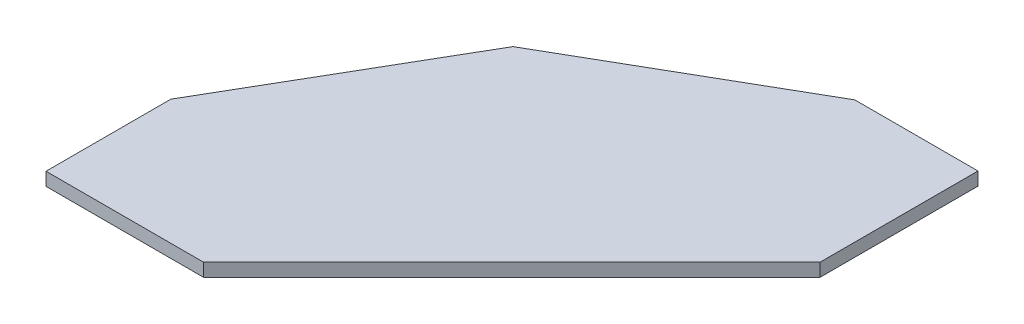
from build123d import *

# Parameters (mm, degrees)
BOSS_EXTRU_1_DEPTH = 23


with BuildPart() as part:
    # Esquisse1 → Boss.-Extru.1 (new body)
    with BuildSketch(Plane(origin=(0, 0, 0), x_dir=(1, 0, 0), z_dir=(0, 1, 0))):
        Polygon((-816.207323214, 218.702093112), (-816.207323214, 0), (-540, 0), (0, 540), (0, 816.959975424), (-215.873570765, 816.959975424), (-596.191805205, 598.260506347), align=None)
    extrude(amount=BOSS_EXTRU_1_DEPTH)


solid = part.part
